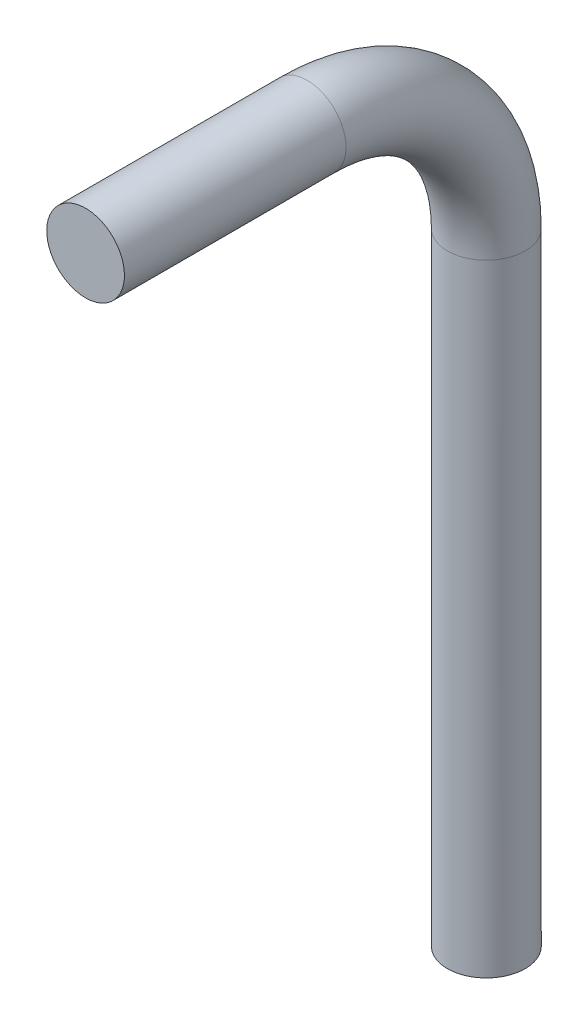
ISO-10303-21;
HEADER;
FILE_DESCRIPTION(('STEP AP214'),'2;1');
FILE_NAME('part.step','',(''),(''),'','','');
FILE_SCHEMA(('AUTOMOTIVE_DESIGN { 1 0 10303 214 1 1 1 1 }'));
ENDSEC;
DATA;
#1=APPLICATION_CONTEXT('core data for automotive mechanical design processes');
#2=APPLICATION_PROTOCOL_DEFINITION('international standard','automotive_design',2000,#1);
#3=PRODUCT_CONTEXT('',#1,'mechanical');
#4=PRODUCT('Part','Part','',(#3));
#5=PRODUCT_RELATED_PRODUCT_CATEGORY('part','',(#4));
#6=PRODUCT_DEFINITION_FORMATION('','',#4);
#7=PRODUCT_DEFINITION_CONTEXT('part definition',#1,'design');
#8=PRODUCT_DEFINITION('design','',#6,#7);
#9=PRODUCT_DEFINITION_SHAPE('','',#8);
#10=(LENGTH_UNIT() NAMED_UNIT(*) SI_UNIT(.MILLI.,.METRE.));
#11=(NAMED_UNIT(*) PLANE_ANGLE_UNIT() SI_UNIT($,.RADIAN.));
#12=(NAMED_UNIT(*) SI_UNIT($,.STERADIAN.) SOLID_ANGLE_UNIT());
#13=UNCERTAINTY_MEASURE_WITH_UNIT(LENGTH_MEASURE(1.E-05),#10,'distance_accuracy_value','');
#14=(GEOMETRIC_REPRESENTATION_CONTEXT(3) GLOBAL_UNCERTAINTY_ASSIGNED_CONTEXT((#13)) GLOBAL_UNIT_ASSIGNED_CONTEXT((#10,
#11,#12)) REPRESENTATION_CONTEXT('',''));
#15=CARTESIAN_POINT('',(0.,0.,0.));
#16=DIRECTION('',(0.,0.,1.));
#17=DIRECTION('',(1.,0.,0.));
#18=AXIS2_PLACEMENT_3D('',#15,#16,#17);
#19=CARTESIAN_POINT('',(0.,0.,0.));
#20=DIRECTION('',(0.,1.,0.));
#21=DIRECTION('',(0.,0.,1.));
#22=AXIS2_PLACEMENT_3D('',#19,#20,#21);
#23=PLANE('',#22);
#24=CARTESIAN_POINT('',(0.,0.,0.));
#25=DIRECTION('',(0.,1.,0.));
#26=DIRECTION('',(0.,0.,1.));
#27=AXIS2_PLACEMENT_3D('',#24,#25,#26);
#28=CIRCLE('',#27,25.4);
#29=CARTESIAN_POINT('',(0.,0.,25.4));
#30=VERTEX_POINT('',#29);
#31=EDGE_CURVE('E47',#30,#30,#28,.T.);
#32=ORIENTED_EDGE('',*,*,#31,.F.);
#33=EDGE_LOOP('',(#32));
#34=FACE_BOUND('',#33,.T.);
#35=ADVANCED_FACE('F33',(#34),#23,.F.);
#36=CARTESIAN_POINT('',(0.,523.521183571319,261.998667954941));
#37=DIRECTION('',(0.,0.,1.));
#38=DIRECTION('',(0.,-1.,0.));
#39=AXIS2_PLACEMENT_3D('',#36,#37,#38);
#40=PLANE('',#39);
#41=CARTESIAN_POINT('',(0.,523.521183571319,261.998667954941));
#42=DIRECTION('',(0.,0.,1.));
#43=DIRECTION('',(0.,-1.,0.));
#44=AXIS2_PLACEMENT_3D('',#41,#42,#43);
#45=CIRCLE('',#44,25.4);
#46=CARTESIAN_POINT('',(0.,498.121183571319,261.998667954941));
#47=VERTEX_POINT('',#46);
#48=EDGE_CURVE('E10',#47,#47,#45,.T.);
#49=ORIENTED_EDGE('',*,*,#48,.T.);
#50=EDGE_LOOP('',(#49));
#51=FACE_BOUND('',#50,.T.);
#52=ADVANCED_FACE('F56',(#51),#40,.T.);
#53=CARTESIAN_POINT('',(0.,0.,0.));
#54=DIRECTION('',(0.,1.,0.));
#55=DIRECTION('',(0.,0.,1.));
#56=AXIS2_PLACEMENT_3D('',#53,#54,#55);
#57=CYLINDRICAL_SURFACE('',#56,25.4);
#58=CARTESIAN_POINT('',(0.,406.4,0.));
#59=DIRECTION('',(0.,1.,0.));
#60=DIRECTION('',(0.,0.,1.));
#61=AXIS2_PLACEMENT_3D('',#58,#59,#60);
#62=CIRCLE('',#61,25.4);
#63=CARTESIAN_POINT('',(0.,406.4,-25.4));
#64=VERTEX_POINT('',#63);
#65=EDGE_CURVE('E43',#64,#64,#62,.T.);
#66=ORIENTED_EDGE('',*,*,#65,.F.);
#67=EDGE_LOOP('',(#66));
#68=FACE_BOUND('',#67,.T.);
#69=ORIENTED_EDGE('',*,*,#31,.T.);
#70=EDGE_LOOP('',(#69));
#71=FACE_BOUND('',#70,.T.);
#72=ADVANCED_FACE('F53',(#68,#71),#57,.T.);
#73=CARTESIAN_POINT('',(0.,406.4,117.121183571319));
#74=DIRECTION('',(1.,0.,0.));
#75=DIRECTION('',(0.,0.,-1.));
#76=AXIS2_PLACEMENT_3D('',#73,#74,#75);
#77=TOROIDAL_SURFACE('',#76,117.121183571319,25.4);
#78=CARTESIAN_POINT('',(0.,523.521183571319,117.121183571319));
#79=DIRECTION('',(0.,0.,1.));
#80=DIRECTION('',(0.,-1.,0.));
#81=AXIS2_PLACEMENT_3D('',#78,#79,#80);
#82=CIRCLE('',#81,25.4);
#83=CARTESIAN_POINT('',(0.,548.921183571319,117.121183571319));
#84=VERTEX_POINT('',#83);
#85=EDGE_CURVE('E39',#84,#84,#82,.T.);
#86=CARTESIAN_POINT('',(0.,406.4,117.121183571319));
#87=DIRECTION('',(1.,0.,0.));
#88=DIRECTION('',(0.,0.,-1.));
#89=AXIS2_PLACEMENT_3D('',#86,#87,#88);
#90=CIRCLE('',#89,142.521183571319);
#91=EDGE_CURVE('',#64,#84,#90,.T.);
#92=ORIENTED_EDGE('',*,*,#65,.T.);
#93=ORIENTED_EDGE('',*,*,#85,.F.);
#94=ORIENTED_EDGE('',*,*,#91,.T.);
#95=ORIENTED_EDGE('',*,*,#91,.F.);
#96=EDGE_LOOP('',(#92,#94,#93,#95));
#97=FACE_BOUND('',#96,.T.);
#98=ADVANCED_FACE('F62',(#97),#77,.T.);
#99=CARTESIAN_POINT('',(0.,523.521183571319,117.121183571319));
#100=DIRECTION('',(0.,0.,1.));
#101=DIRECTION('',(0.,-1.,0.));
#102=AXIS2_PLACEMENT_3D('',#99,#100,#101);
#103=CYLINDRICAL_SURFACE('',#102,25.4);
#104=ORIENTED_EDGE('',*,*,#48,.F.);
#105=EDGE_LOOP('',(#104));
#106=FACE_BOUND('',#105,.T.);
#107=ORIENTED_EDGE('',*,*,#85,.T.);
#108=EDGE_LOOP('',(#107));
#109=FACE_BOUND('',#108,.T.);
#110=ADVANCED_FACE('F60',(#106,#109),#103,.T.);
#111=CLOSED_SHELL('',(#35,#52,#72,#98,#110));
#112=MANIFOLD_SOLID_BREP('B2',#111);
#113=ADVANCED_BREP_SHAPE_REPRESENTATION('',(#18,#112),#14);
#114=SHAPE_DEFINITION_REPRESENTATION(#9,#113);
ENDSEC;
END-ISO-10303-21;
